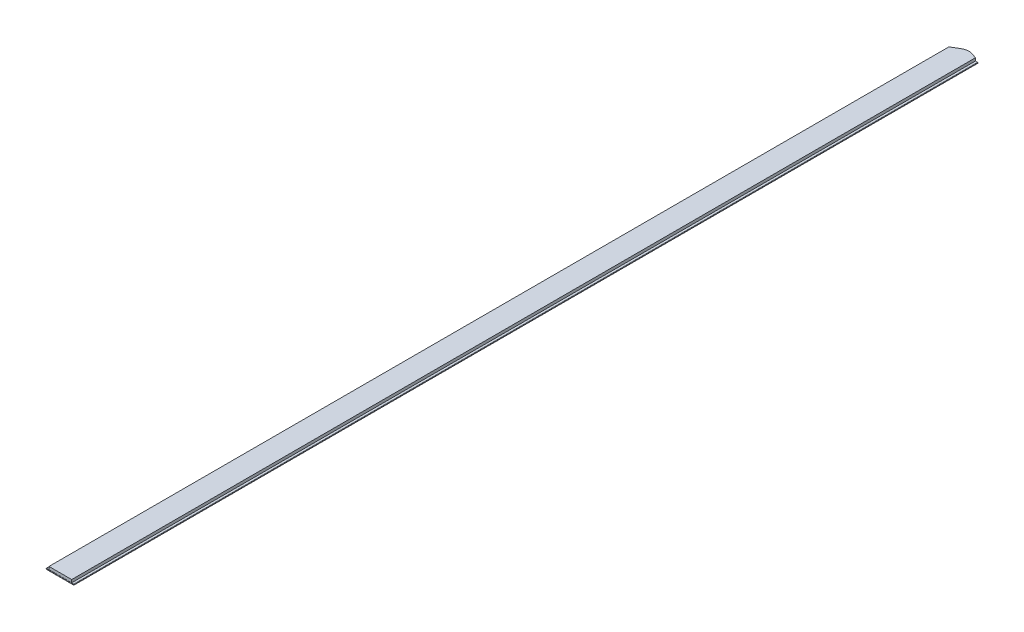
ISO-10303-21;
HEADER;
FILE_DESCRIPTION(('STEP AP214'),'2;1');
FILE_NAME('part.step','',(''),(''),'','','');
FILE_SCHEMA(('AUTOMOTIVE_DESIGN { 1 0 10303 214 1 1 1 1 }'));
ENDSEC;
DATA;
#1=APPLICATION_CONTEXT('core data for automotive mechanical design processes');
#2=APPLICATION_PROTOCOL_DEFINITION('international standard','automotive_design',2000,#1);
#3=PRODUCT_CONTEXT('',#1,'mechanical');
#4=PRODUCT('Part','Part','',(#3));
#5=PRODUCT_RELATED_PRODUCT_CATEGORY('part','',(#4));
#6=PRODUCT_DEFINITION_FORMATION('','',#4);
#7=PRODUCT_DEFINITION_CONTEXT('part definition',#1,'design');
#8=PRODUCT_DEFINITION('design','',#6,#7);
#9=PRODUCT_DEFINITION_SHAPE('','',#8);
#10=(LENGTH_UNIT() NAMED_UNIT(*) SI_UNIT(.MILLI.,.METRE.));
#11=(NAMED_UNIT(*) PLANE_ANGLE_UNIT() SI_UNIT($,.RADIAN.));
#12=(NAMED_UNIT(*) SI_UNIT($,.STERADIAN.) SOLID_ANGLE_UNIT());
#13=UNCERTAINTY_MEASURE_WITH_UNIT(LENGTH_MEASURE(1.E-05),#10,'distance_accuracy_value','');
#14=(GEOMETRIC_REPRESENTATION_CONTEXT(3) GLOBAL_UNCERTAINTY_ASSIGNED_CONTEXT((#13)) GLOBAL_UNIT_ASSIGNED_CONTEXT((#10,
#11,#12)) REPRESENTATION_CONTEXT('',''));
#15=CARTESIAN_POINT('',(0.,0.,0.));
#16=DIRECTION('',(0.,0.,1.));
#17=DIRECTION('',(1.,0.,0.));
#18=AXIS2_PLACEMENT_3D('',#15,#16,#17);
#19=CARTESIAN_POINT('',(0.,0.3,-320.));
#20=DIRECTION('',(0.,1.,0.));
#21=DIRECTION('',(0.,0.,1.));
#22=AXIS2_PLACEMENT_3D('',#19,#20,#21);
#23=PLANE('',#22);
#24=DIRECTION('',(-1.,0.,0.));
#25=VECTOR('',#24,1.);
#26=CARTESIAN_POINT('',(0.,0.3,0.));
#27=LINE('',#26,#25);
#28=CARTESIAN_POINT('',(9.75,0.3,0.));
#29=VERTEX_POINT('',#28);
#30=CARTESIAN_POINT('',(0.15,0.3,0.));
#31=VERTEX_POINT('',#30);
#32=EDGE_CURVE('E142',#29,#31,#27,.T.);
#33=ORIENTED_EDGE('',*,*,#32,.F.);
#34=DIRECTION('',(0.,0.,1.));
#35=VECTOR('',#34,1.);
#36=CARTESIAN_POINT('',(9.75,0.3,-320.));
#37=LINE('',#36,#35);
#38=CARTESIAN_POINT('',(9.75000000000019,0.3,-318.473259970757));
#39=VERTEX_POINT('',#38);
#40=EDGE_CURVE('E11',#29,#39,#37,.F.);
#41=ORIENTED_EDGE('',*,*,#40,.T.);
#42=CARTESIAN_POINT('',(-1.63967066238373,0.3,-316.676471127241));
#43=CARTESIAN_POINT('',(0.602236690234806,0.3,-315.828406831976));
#44=CARTESIAN_POINT('',(4.44296575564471,0.3,-320.977939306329));
#45=CARTESIAN_POINT('',(10.1434829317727,0.3,-317.373909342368));
#46=CARTESIAN_POINT('',(15.6515747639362,0.3,-321.898147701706));
#47=CARTESIAN_POINT('',(17.053288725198,0.3,-332.163947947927));
#48=CARTESIAN_POINT('',(10.7824810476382,0.3,-332.17101837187));
#49=CARTESIAN_POINT('',(1.13918395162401,0.3,-332.450965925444));
#50=CARTESIAN_POINT('',(-5.98283750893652,0.3,-332.883643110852));
#51=CARTESIAN_POINT('',(-6.18735625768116,0.3,-322.977098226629));
#52=CARTESIAN_POINT('',(-3.10281714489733,0.3,-317.229947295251));
#53=CARTESIAN_POINT('',(-1.63967066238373,0.3,-316.676471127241));
#54=B_SPLINE_CURVE_WITH_KNOTS('',3,(#42,#43,#44,#45,#46,#47,#48,#49,#50,#51,#52,#53),
.UNSPECIFIED.,.T.,.F.,(4,1,1,1,1,1,1,1,1,4),(0.,0.140766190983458,0.205480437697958,
0.311340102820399,0.455360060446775,0.633885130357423,0.666506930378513,0.78157806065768,
0.908131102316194,1.),.UNSPECIFIED.);
#55=CARTESIAN_POINT('',(9.00000000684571,0.3,-318.542750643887));
#56=VERTEX_POINT('',#55);
#57=EDGE_CURVE('E196',#56,#39,#54,.T.);
#58=ORIENTED_EDGE('',*,*,#57,.F.);
#59=DIRECTION('',(0.,0.,1.));
#60=VECTOR('',#59,1.);
#61=CARTESIAN_POINT('',(9.,0.3,-320.));
#62=LINE('',#61,#60);
#63=CARTESIAN_POINT('',(9.,0.3,-0.05));
#64=VERTEX_POINT('',#63);
#65=EDGE_CURVE('E127',#56,#64,#62,.T.);
#66=ORIENTED_EDGE('',*,*,#65,.T.);
#67=DIRECTION('',(1.,0.,0.));
#68=VECTOR('',#67,1.);
#69=CARTESIAN_POINT('',(0.648691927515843,0.3,-0.05));
#70=LINE('',#69,#68);
#71=CARTESIAN_POINT('',(1.,0.3,-0.05));
#72=VERTEX_POINT('',#71);
#73=EDGE_CURVE('E110',#72,#64,#70,.T.);
#74=ORIENTED_EDGE('',*,*,#73,.F.);
#75=DIRECTION('',(0.,0.,1.));
#76=VECTOR('',#75,1.);
#77=CARTESIAN_POINT('',(1.,0.3,-320.));
#78=LINE('',#77,#76);
#79=CARTESIAN_POINT('',(0.999999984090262,0.3,-317.138480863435));
#80=VERTEX_POINT('',#79);
#81=EDGE_CURVE('E124',#80,#72,#78,.T.);
#82=ORIENTED_EDGE('',*,*,#81,.F.);
#83=CARTESIAN_POINT('',(-1.63967066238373,0.3,-316.676471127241));
#84=CARTESIAN_POINT('',(0.602236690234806,0.3,-315.828406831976));
#85=CARTESIAN_POINT('',(4.44296575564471,0.3,-320.977939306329));
#86=CARTESIAN_POINT('',(10.1434829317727,0.3,-317.373909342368));
#87=CARTESIAN_POINT('',(15.6515747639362,0.3,-321.898147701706));
#88=CARTESIAN_POINT('',(17.053288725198,0.3,-332.163947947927));
#89=CARTESIAN_POINT('',(10.7824810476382,0.3,-332.17101837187));
#90=CARTESIAN_POINT('',(1.13918395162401,0.3,-332.450965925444));
#91=CARTESIAN_POINT('',(-5.98283750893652,0.3,-332.883643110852));
#92=CARTESIAN_POINT('',(-6.18735625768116,0.3,-322.977098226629));
#93=CARTESIAN_POINT('',(-3.10281714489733,0.3,-317.229947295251));
#94=CARTESIAN_POINT('',(-1.63967066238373,0.3,-316.676471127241));
#95=B_SPLINE_CURVE_WITH_KNOTS('',3,(#83,#84,#85,#86,#87,#88,#89,#90,#91,#92,#93,#94),
.UNSPECIFIED.,.T.,.F.,(4,1,1,1,1,1,1,1,1,4),(0.,0.140766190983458,0.205480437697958,
0.311340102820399,0.455360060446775,0.633885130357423,0.666506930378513,0.78157806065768,
0.908131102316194,1.),.UNSPECIFIED.);
#96=CARTESIAN_POINT('',(0.149999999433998,0.3,-316.752247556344));
#97=VERTEX_POINT('',#96);
#98=EDGE_CURVE('E209',#97,#80,#95,.T.);
#99=ORIENTED_EDGE('',*,*,#98,.F.);
#100=DIRECTION('',(0.,0.,1.));
#101=VECTOR('',#100,1.);
#102=CARTESIAN_POINT('',(0.15,0.3,-320.));
#103=LINE('',#102,#101);
#104=EDGE_CURVE('E41',#97,#31,#103,.T.);
#105=ORIENTED_EDGE('',*,*,#104,.T.);
#106=EDGE_LOOP('',(#33,#41,#58,#66,#74,#82,#99,#105));
#107=FACE_BOUND('',#106,.T.);
#108=ADVANCED_FACE('F31',(#107),#23,.T.);
#109=CARTESIAN_POINT('',(1.,0.3,-320.));
#110=DIRECTION('',(-1.,0.,0.));
#111=DIRECTION('',(0.,0.,1.));
#112=AXIS2_PLACEMENT_3D('',#109,#110,#111);
#113=PLANE('',#112);
#114=DIRECTION('',(0.,-1.,0.));
#115=VECTOR('',#114,1.);
#116=CARTESIAN_POINT('',(1.,0.3,-0.0499999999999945));
#117=LINE('',#116,#115);
#118=CARTESIAN_POINT('',(1.,1.3,-0.0499999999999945));
#119=VERTEX_POINT('',#118);
#120=EDGE_CURVE('E107',#119,#72,#117,.T.);
#121=ORIENTED_EDGE('',*,*,#120,.F.);
#122=DIRECTION('',(0.,0.,1.));
#123=VECTOR('',#122,1.);
#124=CARTESIAN_POINT('',(1.,1.3,-320.));
#125=LINE('',#124,#123);
#126=CARTESIAN_POINT('',(0.999999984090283,1.3,-317.138480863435));
#127=VERTEX_POINT('',#126);
#128=EDGE_CURVE('E135',#127,#119,#125,.T.);
#129=ORIENTED_EDGE('',*,*,#128,.F.);
#130=DIRECTION('',(0.,1.,0.));
#131=VECTOR('',#130,1.);
#132=CARTESIAN_POINT('',(1.,-0.7,-317.13848087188));
#133=LINE('',#132,#131);
#134=EDGE_CURVE('E133',#80,#127,#133,.T.);
#135=ORIENTED_EDGE('',*,*,#134,.F.);
#136=ORIENTED_EDGE('',*,*,#81,.T.);
#137=EDGE_LOOP('',(#121,#129,#135,#136));
#138=FACE_BOUND('',#137,.T.);
#139=ADVANCED_FACE('F132',(#138),#113,.T.);
#140=CARTESIAN_POINT('',(1.,1.3,-320.));
#141=DIRECTION('',(0.,1.,0.));
#142=DIRECTION('',(0.,0.,1.));
#143=AXIS2_PLACEMENT_3D('',#140,#141,#142);
#144=PLANE('',#143);
#145=DIRECTION('',(-1.,0.,0.));
#146=VECTOR('',#145,1.);
#147=CARTESIAN_POINT('',(1.,1.3,-0.0499999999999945));
#148=LINE('',#147,#146);
#149=CARTESIAN_POINT('',(9.,1.3,-0.0499999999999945));
#150=VERTEX_POINT('',#149);
#151=EDGE_CURVE('E113',#150,#119,#148,.T.);
#152=ORIENTED_EDGE('',*,*,#151,.F.);
#153=DIRECTION('',(0.,0.,1.));
#154=VECTOR('',#153,1.);
#155=CARTESIAN_POINT('',(9.,1.3,-320.));
#156=LINE('',#155,#154);
#157=CARTESIAN_POINT('',(9.00000000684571,1.3,-318.542750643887));
#158=VERTEX_POINT('',#157);
#159=EDGE_CURVE('E139',#158,#150,#156,.T.);
#160=ORIENTED_EDGE('',*,*,#159,.F.);
#161=CARTESIAN_POINT('',(-1.63967066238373,1.3,-316.676471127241));
#162=CARTESIAN_POINT('',(0.602236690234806,1.3,-315.828406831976));
#163=CARTESIAN_POINT('',(4.44296575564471,1.3,-320.977939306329));
#164=CARTESIAN_POINT('',(10.1434829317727,1.3,-317.373909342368));
#165=CARTESIAN_POINT('',(15.6515747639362,1.3,-321.898147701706));
#166=CARTESIAN_POINT('',(17.053288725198,1.3,-332.163947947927));
#167=CARTESIAN_POINT('',(10.7824810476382,1.3,-332.17101837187));
#168=CARTESIAN_POINT('',(1.13918395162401,1.3,-332.450965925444));
#169=CARTESIAN_POINT('',(-5.98283750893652,1.3,-332.883643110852));
#170=CARTESIAN_POINT('',(-6.18735625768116,1.3,-322.977098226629));
#171=CARTESIAN_POINT('',(-3.10281714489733,1.3,-317.229947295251));
#172=CARTESIAN_POINT('',(-1.63967066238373,1.3,-316.676471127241));
#173=B_SPLINE_CURVE_WITH_KNOTS('',3,(#161,#162,#163,#164,#165,#166,#167,#168,#169,#170,#171,
#172),.UNSPECIFIED.,.T.,.F.,(4,1,1,1,1,1,1,1,1,4),(0.,0.140766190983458,0.205480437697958,
0.311340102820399,0.455360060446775,0.633885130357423,0.666506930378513,0.78157806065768,
0.908131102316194,1.),.UNSPECIFIED.);
#174=EDGE_CURVE('E118',#127,#158,#173,.T.);
#175=ORIENTED_EDGE('',*,*,#174,.F.);
#176=ORIENTED_EDGE('',*,*,#128,.T.);
#177=EDGE_LOOP('',(#152,#160,#175,#176));
#178=FACE_BOUND('',#177,.T.);
#179=ADVANCED_FACE('F252',(#178),#144,.T.);
#180=CARTESIAN_POINT('',(9.,0.3,-320.));
#181=DIRECTION('',(1.,0.,0.));
#182=DIRECTION('',(0.,0.,-1.));
#183=AXIS2_PLACEMENT_3D('',#180,#181,#182);
#184=PLANE('',#183);
#185=DIRECTION('',(0.,1.,0.));
#186=VECTOR('',#185,1.);
#187=CARTESIAN_POINT('',(9.,0.3,-0.0499999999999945));
#188=LINE('',#187,#186);
#189=EDGE_CURVE('E128',#64,#150,#188,.T.);
#190=ORIENTED_EDGE('',*,*,#189,.F.);
#191=ORIENTED_EDGE('',*,*,#65,.F.);
#192=DIRECTION('',(0.,1.,0.));
#193=VECTOR('',#192,1.);
#194=CARTESIAN_POINT('',(9.00000000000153,-0.7,-318.54275064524));
#195=LINE('',#194,#193);
#196=EDGE_CURVE('E204',#158,#56,#195,.F.);
#197=ORIENTED_EDGE('',*,*,#196,.F.);
#198=ORIENTED_EDGE('',*,*,#159,.T.);
#199=EDGE_LOOP('',(#190,#191,#197,#198));
#200=FACE_BOUND('',#199,.T.);
#201=ADVANCED_FACE('F250',(#200),#184,.T.);
#202=CARTESIAN_POINT('',(0.,0.,-320.));
#203=DIRECTION('',(0.,-1.,0.));
#204=DIRECTION('',(0.,0.,-1.));
#205=AXIS2_PLACEMENT_3D('',#202,#203,#204);
#206=PLANE('',#205);
#207=CARTESIAN_POINT('',(-1.63967066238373,0.,-316.676471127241));
#208=CARTESIAN_POINT('',(0.602236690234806,0.,-315.828406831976));
#209=CARTESIAN_POINT('',(4.44296575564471,0.,-320.977939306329));
#210=CARTESIAN_POINT('',(10.1434829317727,0.,-317.373909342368));
#211=CARTESIAN_POINT('',(15.6515747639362,0.,-321.898147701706));
#212=CARTESIAN_POINT('',(17.053288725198,0.,-332.163947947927));
#213=CARTESIAN_POINT('',(10.7824810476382,0.,-332.17101837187));
#214=CARTESIAN_POINT('',(1.13918395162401,0.,-332.450965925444));
#215=CARTESIAN_POINT('',(-5.98283750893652,0.,-332.883643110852));
#216=CARTESIAN_POINT('',(-6.18735625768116,0.,-322.977098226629));
#217=CARTESIAN_POINT('',(-3.10281714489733,0.,-317.229947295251));
#218=CARTESIAN_POINT('',(-1.63967066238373,0.,-316.676471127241));
#219=B_SPLINE_CURVE_WITH_KNOTS('',3,(#207,#208,#209,#210,#211,#212,#213,#214,#215,#216,#217,
#218),.UNSPECIFIED.,.T.,.F.,(4,1,1,1,1,1,1,1,1,4),(0.,0.140766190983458,0.205480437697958,
0.311340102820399,0.455360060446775,0.633885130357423,0.666506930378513,0.78157806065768,
0.908131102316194,1.),.UNSPECIFIED.);
#220=CARTESIAN_POINT('',(9.75000000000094,0.,-318.473259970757));
#221=VERTEX_POINT('',#220);
#222=CARTESIAN_POINT('',(0.14999999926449,0.,-316.752247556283));
#223=VERTEX_POINT('',#222);
#224=EDGE_CURVE('E134',#221,#223,#219,.F.);
#225=ORIENTED_EDGE('',*,*,#224,.F.);
#226=DIRECTION('',(0.,0.,1.));
#227=VECTOR('',#226,1.);
#228=CARTESIAN_POINT('',(9.75,0.,-320.));
#229=LINE('',#228,#227);
#230=CARTESIAN_POINT('',(9.75,0.,0.));
#231=VERTEX_POINT('',#230);
#232=EDGE_CURVE('E155',#221,#231,#229,.T.);
#233=ORIENTED_EDGE('',*,*,#232,.T.);
#234=DIRECTION('',(1.,0.,0.));
#235=VECTOR('',#234,1.);
#236=CARTESIAN_POINT('',(0.,0.,0.));
#237=LINE('',#236,#235);
#238=CARTESIAN_POINT('',(0.15,0.,0.));
#239=VERTEX_POINT('',#238);
#240=EDGE_CURVE('E216',#239,#231,#237,.T.);
#241=ORIENTED_EDGE('',*,*,#240,.F.);
#242=DIRECTION('',(0.,0.,1.));
#243=VECTOR('',#242,1.);
#244=CARTESIAN_POINT('',(0.15,0.,-320.));
#245=LINE('',#244,#243);
#246=EDGE_CURVE('E137',#239,#223,#245,.F.);
#247=ORIENTED_EDGE('',*,*,#246,.T.);
#248=EDGE_LOOP('',(#225,#233,#241,#247));
#249=FACE_BOUND('',#248,.T.);
#250=ADVANCED_FACE('F234',(#249),#206,.T.);
#251=CARTESIAN_POINT('',(0.,0.3,0.));
#252=DIRECTION('',(0.,0.,-1.));
#253=DIRECTION('',(-1.,0.,0.));
#254=AXIS2_PLACEMENT_3D('',#251,#252,#253);
#255=PLANE('',#254);
#256=ORIENTED_EDGE('',*,*,#240,.T.);
#257=CARTESIAN_POINT('',(9.75,0.15,0.));
#258=DIRECTION('',(0.,0.,-1.));
#259=DIRECTION('',(-1.,0.,0.));
#260=AXIS2_PLACEMENT_3D('',#257,#258,#259);
#261=CIRCLE('',#260,0.15);
#262=CARTESIAN_POINT('',(9.9,0.15,0.));
#263=VERTEX_POINT('',#262);
#264=EDGE_CURVE('E164',#231,#263,#261,.F.);
#265=ORIENTED_EDGE('',*,*,#264,.T.);
#266=CARTESIAN_POINT('',(9.75,0.15,0.));
#267=DIRECTION('',(0.,0.,-1.));
#268=DIRECTION('',(-1.,0.,0.));
#269=AXIS2_PLACEMENT_3D('',#266,#267,#268);
#270=CIRCLE('',#269,0.15);
#271=EDGE_CURVE('E162',#263,#29,#270,.F.);
#272=ORIENTED_EDGE('',*,*,#271,.T.);
#273=ORIENTED_EDGE('',*,*,#32,.T.);
#274=CARTESIAN_POINT('',(0.15,0.15,0.));
#275=DIRECTION('',(0.,0.,-1.));
#276=DIRECTION('',(-1.,0.,0.));
#277=AXIS2_PLACEMENT_3D('',#274,#275,#276);
#278=CIRCLE('',#277,0.15);
#279=CARTESIAN_POINT('',(0.,0.15,0.));
#280=VERTEX_POINT('',#279);
#281=EDGE_CURVE('E158',#31,#280,#278,.F.);
#282=ORIENTED_EDGE('',*,*,#281,.T.);
#283=CARTESIAN_POINT('',(0.15,0.15,0.));
#284=DIRECTION('',(0.,0.,-1.));
#285=DIRECTION('',(-1.,0.,0.));
#286=AXIS2_PLACEMENT_3D('',#283,#284,#285);
#287=CIRCLE('',#286,0.15);
#288=EDGE_CURVE('E160',#280,#239,#287,.F.);
#289=ORIENTED_EDGE('',*,*,#288,.T.);
#290=EDGE_LOOP('',(#256,#265,#272,#273,#282,#289));
#291=FACE_BOUND('',#290,.T.);
#292=ADVANCED_FACE('F181',(#291),#255,.F.);
#293=CARTESIAN_POINT('',(-1.63967066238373,-0.7,-316.676471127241));
#294=CARTESIAN_POINT('',(0.602236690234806,-0.7,-315.828406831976));
#295=CARTESIAN_POINT('',(4.44296575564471,-0.7,-320.977939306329));
#296=CARTESIAN_POINT('',(10.1434829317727,-0.7,-317.373909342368));
#297=CARTESIAN_POINT('',(15.6515747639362,-0.7,-321.898147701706));
#298=CARTESIAN_POINT('',(17.053288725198,-0.7,-332.163947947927));
#299=CARTESIAN_POINT('',(10.7824810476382,-0.7,-332.17101837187));
#300=CARTESIAN_POINT('',(1.13918395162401,-0.7,-332.450965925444));
#301=CARTESIAN_POINT('',(-5.98283750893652,-0.7,-332.883643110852));
#302=CARTESIAN_POINT('',(-6.18735625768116,-0.7,-322.977098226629));
#303=CARTESIAN_POINT('',(-3.10281714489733,-0.7,-317.229947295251));
#304=CARTESIAN_POINT('',(-1.63967066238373,-0.7,-316.676471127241));
#305=B_SPLINE_CURVE_WITH_KNOTS('',3,(#293,#294,#295,#296,#297,#298,#299,#300,#301,#302,#303,
#304),.UNSPECIFIED.,.T.,.F.,(4,1,1,1,1,1,1,1,1,4),(0.,0.140766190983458,0.205480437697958,
0.311340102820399,0.455360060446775,0.633885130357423,0.666506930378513,0.78157806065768,
0.908131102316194,1.),.UNSPECIFIED.);
#306=DIRECTION('',(0.,1.,0.));
#307=VECTOR('',#306,1.);
#308=SURFACE_OF_LINEAR_EXTRUSION('',#305,#307);
#309=CARTESIAN_POINT('',(9.75,0.3,-318.473259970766));
#310=CARTESIAN_POINT('',(9.75844091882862,0.300006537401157,-318.473429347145));
#311=CARTESIAN_POINT('',(9.76687820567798,0.299287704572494,-318.473633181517));
#312=CARTESIAN_POINT('',(9.78350576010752,0.296451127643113,-318.474095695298));
#313=CARTESIAN_POINT('',(9.79169622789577,0.294334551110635,-318.474354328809));
#314=CARTESIAN_POINT('',(9.80760880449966,0.288752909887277,-318.474912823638));
#315=CARTESIAN_POINT('',(9.81533070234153,0.285287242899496,-318.47521270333));
#316=CARTESIAN_POINT('',(9.83007713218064,0.277118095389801,-318.475832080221));
#317=CARTESIAN_POINT('',(9.83710177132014,0.272414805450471,-318.476151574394));
#318=CARTESIAN_POINT('',(9.85683365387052,0.256621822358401,-318.477104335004));
#319=CARTESIAN_POINT('',(9.86824239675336,0.243833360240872,-318.477733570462));
#320=CARTESIAN_POINT('',(9.88615404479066,0.2151712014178,-318.478775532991));
#321=CARTESIAN_POINT('',(9.89265762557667,0.199297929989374,-318.479188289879));
#322=CARTESIAN_POINT('',(9.89756751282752,0.177478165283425,-318.47950280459));
#323=CARTESIAN_POINT('',(9.89847877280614,0.172020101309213,-318.479561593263));
#324=CARTESIAN_POINT('',(9.89969359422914,0.161044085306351,-318.479640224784));
#325=CARTESIAN_POINT('',(9.89999800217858,0.155526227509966,-318.479660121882));
#326=CARTESIAN_POINT('',(9.90000000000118,0.150000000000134,-318.479660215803));
#327=B_SPLINE_CURVE_WITH_KNOTS('',3,(#309,#310,#311,#312,#313,#314,#315,#316,#317,#318,#319,
#320,#321,#322,#323,#324,#325,#326),.UNSPECIFIED.,.F.,.F.,(4,2,2,2,2,2,2,2,4),(0.,
0.0252926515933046,0.0505642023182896,0.0758470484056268,0.101126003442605,0.151551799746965,
0.201970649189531,0.218547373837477,0.235100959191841),.UNSPECIFIED.);
#328=CARTESIAN_POINT('',(9.9,0.15,-318.479660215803));
#329=VERTEX_POINT('',#328);
#330=EDGE_CURVE('E245',#39,#329,#327,.T.);
#331=ORIENTED_EDGE('',*,*,#330,.T.);
#332=CARTESIAN_POINT('',(9.9,0.15,-318.479660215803));
#333=CARTESIAN_POINT('',(9.90000660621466,0.141571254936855,-318.479661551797));
#334=CARTESIAN_POINT('',(9.89928976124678,0.133145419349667,-318.479614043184));
#335=CARTESIAN_POINT('',(9.89646080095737,0.116539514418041,-318.479431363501));
#336=CARTESIAN_POINT('',(9.89434989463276,0.108359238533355,-318.479296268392));
#337=CARTESIAN_POINT('',(9.88878303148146,0.0924654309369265,-318.478948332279));
#338=CARTESIAN_POINT('',(9.88532647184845,0.0847521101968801,-318.478735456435));
#339=CARTESIAN_POINT('',(9.87717896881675,0.0700208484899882,-318.478250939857));
#340=CARTESIAN_POINT('',(9.87248820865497,0.0630028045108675,-318.477979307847));
#341=CARTESIAN_POINT('',(9.85673439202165,0.0432818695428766,-318.477108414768));
#342=CARTESIAN_POINT('',(9.84397648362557,0.0318751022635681,-318.476452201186));
#343=CARTESIAN_POINT('',(9.81536111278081,0.0139369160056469,-318.475192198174));
#344=CARTESIAN_POINT('',(9.79949938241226,0.00741227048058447,-318.474588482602));
#345=CARTESIAN_POINT('',(9.77765361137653,0.00246393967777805,-318.473929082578));
#346=CARTESIAN_POINT('',(9.77216153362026,0.00154094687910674,-318.473776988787));
#347=CARTESIAN_POINT('',(9.7611158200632,0.000310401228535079,-318.473498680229));
#348=CARTESIAN_POINT('',(9.75556228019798,1.99662436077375E-06,-318.473372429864));
#349=CARTESIAN_POINT('',(9.75000000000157,-1.45955296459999E-12,-318.473259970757));
#350=B_SPLINE_CURVE_WITH_KNOTS('',3,(#332,#333,#334,#335,#336,#337,#338,#339,#340,#341,#342,
#343,#344,#345,#346,#347,#348,#349),.UNSPECIFIED.,.F.,.F.,(4,2,2,2,2,2,2,2,4),(0.,
0.0252511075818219,0.0504803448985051,0.0757208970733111,0.100957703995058,0.151318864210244,
0.201749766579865,0.218437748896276,0.235102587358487),.UNSPECIFIED.);
#351=EDGE_CURVE('E240',#329,#221,#350,.T.);
#352=ORIENTED_EDGE('',*,*,#351,.T.);
#353=ORIENTED_EDGE('',*,*,#224,.T.);
#354=CARTESIAN_POINT('',(0.15,0.,-316.75224755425));
#355=CARTESIAN_POINT('',(0.141219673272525,2.21270672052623E-06,-316.749070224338));
#356=CARTESIAN_POINT('',(0.132442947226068,0.00077278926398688,-316.745925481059));
#357=CARTESIAN_POINT('',(0.115101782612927,0.00384873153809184,-316.739769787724));
#358=CARTESIAN_POINT('',(0.10653764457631,0.00615615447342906,-316.736759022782));
#359=CARTESIAN_POINT('',(0.0815568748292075,0.0153597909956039,-316.728060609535));
#360=CARTESIAN_POINT('',(0.0657982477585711,0.0245374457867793,-316.722687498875));
#361=CARTESIAN_POINT('',(0.0388170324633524,0.04781072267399,-316.713624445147));
#362=CARTESIAN_POINT('',(0.027450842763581,0.0617162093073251,-316.709880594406));
#363=CARTESIAN_POINT('',(0.0147365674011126,0.0846069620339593,-316.705726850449));
#364=CARTESIAN_POINT('',(0.0112616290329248,0.0923434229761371,-316.704598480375));
#365=CARTESIAN_POINT('',(0.00565663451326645,0.108335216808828,-316.702783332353));
#366=CARTESIAN_POINT('',(0.0035247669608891,0.116589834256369,-316.702095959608));
#367=CARTESIAN_POINT('',(0.000701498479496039,0.133231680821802,-316.701187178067));
#368=CARTESIAN_POINT('',(-1.19804401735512E-05,0.141614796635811,-316.7009586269));
#369=CARTESIAN_POINT('',(0.,0.14999999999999,-316.70096166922));
#370=B_SPLINE_CURVE_WITH_KNOTS('',3,(#354,#355,#356,#357,#358,#359,#360,#361,#362,#363,#364,
#365,#366,#367,#368,#369),.UNSPECIFIED.,.F.,.F.,(4,2,2,2,2,2,2,4),(0.,0.0279506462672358,
0.0559387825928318,0.111752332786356,0.165544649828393,0.191100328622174,0.216621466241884,
0.241742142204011),.UNSPECIFIED.);
#371=CARTESIAN_POINT('',(0.,0.15,-316.70096166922));
#372=VERTEX_POINT('',#371);
#373=EDGE_CURVE('E54',#223,#372,#370,.T.);
#374=ORIENTED_EDGE('',*,*,#373,.T.);
#375=CARTESIAN_POINT('',(0.,0.15,-316.70096166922));
#376=CARTESIAN_POINT('',(-7.94650092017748E-06,0.15813668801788,-316.700959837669));
#377=CARTESIAN_POINT('',(0.000661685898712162,0.166268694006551,-316.701174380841));
#378=CARTESIAN_POINT('',(0.00329302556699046,0.18228220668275,-316.702021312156));
#379=CARTESIAN_POINT('',(0.00525211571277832,0.190164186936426,-316.702652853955));
#380=CARTESIAN_POINT('',(0.0103999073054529,0.205471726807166,-316.704319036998));
#381=CARTESIAN_POINT('',(0.0135886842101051,0.212897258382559,-316.705353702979));
#382=CARTESIAN_POINT('',(0.0210754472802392,0.22709158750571,-316.707796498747));
#383=CARTESIAN_POINT('',(0.0253736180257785,0.233860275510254,-316.709204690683));
#384=CARTESIAN_POINT('',(0.0399105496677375,0.253154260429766,-316.71399976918));
#385=CARTESIAN_POINT('',(0.0517051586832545,0.264419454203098,-316.717929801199));
#386=CARTESIAN_POINT('',(0.0785642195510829,0.282950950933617,-316.727044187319));
#387=CARTESIAN_POINT('',(0.0937544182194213,0.290008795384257,-316.732278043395));
#388=CARTESIAN_POINT('',(0.116121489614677,0.296287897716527,-316.740133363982));
#389=CARTESIAN_POINT('',(0.122841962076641,0.297680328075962,-316.742511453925));
#390=CARTESIAN_POINT('',(0.136373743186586,0.299534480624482,-316.747335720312));
#391=CARTESIAN_POINT('',(0.143184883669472,0.299997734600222,-316.749781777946));
#392=CARTESIAN_POINT('',(0.149999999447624,0.300000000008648,-316.752247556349));
#393=B_SPLINE_CURVE_WITH_KNOTS('',3,(#375,#376,#377,#378,#379,#380,#381,#382,#383,#384,#385,
#386,#387,#388,#389,#390,#391,#392),.UNSPECIFIED.,.F.,.F.,(4,2,2,2,2,2,2,2,4),(0.,
0.0243723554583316,0.0486953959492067,0.0730199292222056,0.097348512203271,0.146760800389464,
0.198452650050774,0.220194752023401,0.241900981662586),.UNSPECIFIED.);
#394=EDGE_CURVE('E49',#372,#97,#393,.T.);
#395=ORIENTED_EDGE('',*,*,#394,.T.);
#396=ORIENTED_EDGE('',*,*,#98,.T.);
#397=ORIENTED_EDGE('',*,*,#134,.T.);
#398=ORIENTED_EDGE('',*,*,#174,.T.);
#399=ORIENTED_EDGE('',*,*,#196,.T.);
#400=ORIENTED_EDGE('',*,*,#57,.T.);
#401=EDGE_LOOP('',(#331,#352,#353,#374,#395,#396,#397,#398,#399,#400));
#402=FACE_BOUND('',#401,.T.);
#403=ADVANCED_FACE('F175',(#402),#308,.F.);
#404=CARTESIAN_POINT('',(0.648691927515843,1.66839125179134,-0.05));
#405=DIRECTION('',(0.,0.,-1.));
#406=DIRECTION('',(-1.,0.,0.));
#407=AXIS2_PLACEMENT_3D('',#404,#405,#406);
#408=PLANE('',#407);
#409=ORIENTED_EDGE('',*,*,#120,.T.);
#410=ORIENTED_EDGE('',*,*,#73,.T.);
#411=ORIENTED_EDGE('',*,*,#189,.T.);
#412=ORIENTED_EDGE('',*,*,#151,.T.);
#413=EDGE_LOOP('',(#409,#410,#411,#412));
#414=FACE_BOUND('',#413,.T.);
#415=ADVANCED_FACE('F109',(#414),#408,.F.);
#416=CARTESIAN_POINT('',(9.75,0.15,-320.));
#417=DIRECTION('',(0.,0.,1.));
#418=DIRECTION('',(1.,0.,0.));
#419=AXIS2_PLACEMENT_3D('',#416,#417,#418);
#420=CYLINDRICAL_SURFACE('',#419,0.15);
#421=DIRECTION('',(0.,0.,1.));
#422=VECTOR('',#421,1.);
#423=CARTESIAN_POINT('',(9.9,0.15,-320.));
#424=LINE('',#423,#422);
#425=EDGE_CURVE('E129',#329,#263,#424,.T.);
#426=ORIENTED_EDGE('',*,*,#425,.F.);
#427=ORIENTED_EDGE('',*,*,#330,.F.);
#428=ORIENTED_EDGE('',*,*,#40,.F.);
#429=ORIENTED_EDGE('',*,*,#271,.F.);
#430=EDGE_LOOP('',(#426,#427,#428,#429));
#431=FACE_BOUND('',#430,.T.);
#432=ADVANCED_FACE('F243',(#431),#420,.T.);
#433=CARTESIAN_POINT('',(9.75,0.15,-320.));
#434=DIRECTION('',(0.,0.,1.));
#435=DIRECTION('',(1.,0.,0.));
#436=AXIS2_PLACEMENT_3D('',#433,#434,#435);
#437=CYLINDRICAL_SURFACE('',#436,0.15);
#438=ORIENTED_EDGE('',*,*,#351,.F.);
#439=ORIENTED_EDGE('',*,*,#425,.T.);
#440=ORIENTED_EDGE('',*,*,#264,.F.);
#441=ORIENTED_EDGE('',*,*,#232,.F.);
#442=EDGE_LOOP('',(#438,#439,#440,#441));
#443=FACE_BOUND('',#442,.T.);
#444=ADVANCED_FACE('F238',(#443),#437,.T.);
#445=CARTESIAN_POINT('',(0.15,0.15,-320.));
#446=DIRECTION('',(0.,0.,1.));
#447=DIRECTION('',(1.,0.,0.));
#448=AXIS2_PLACEMENT_3D('',#445,#446,#447);
#449=CYLINDRICAL_SURFACE('',#448,0.15);
#450=ORIENTED_EDGE('',*,*,#104,.F.);
#451=ORIENTED_EDGE('',*,*,#394,.F.);
#452=DIRECTION('',(0.,0.,1.));
#453=VECTOR('',#452,1.);
#454=CARTESIAN_POINT('',(0.,0.15,-320.));
#455=LINE('',#454,#453);
#456=EDGE_CURVE('E36',#280,#372,#455,.F.);
#457=ORIENTED_EDGE('',*,*,#456,.F.);
#458=ORIENTED_EDGE('',*,*,#281,.F.);
#459=EDGE_LOOP('',(#450,#451,#457,#458));
#460=FACE_BOUND('',#459,.T.);
#461=ADVANCED_FACE('F33',(#460),#449,.T.);
#462=CARTESIAN_POINT('',(0.15,0.15,-320.));
#463=DIRECTION('',(0.,0.,1.));
#464=DIRECTION('',(1.,0.,0.));
#465=AXIS2_PLACEMENT_3D('',#462,#463,#464);
#466=CYLINDRICAL_SURFACE('',#465,0.15);
#467=ORIENTED_EDGE('',*,*,#373,.F.);
#468=ORIENTED_EDGE('',*,*,#246,.F.);
#469=ORIENTED_EDGE('',*,*,#288,.F.);
#470=ORIENTED_EDGE('',*,*,#456,.T.);
#471=EDGE_LOOP('',(#467,#468,#469,#470));
#472=FACE_BOUND('',#471,.T.);
#473=ADVANCED_FACE('F231',(#472),#466,.T.);
#474=CLOSED_SHELL('',(#108,#139,#179,#201,#250,#292,#403,#415,#432,#444,#461,#473));
#475=MANIFOLD_SOLID_BREP('B2',#474);
#476=ADVANCED_BREP_SHAPE_REPRESENTATION('',(#18,#475),#14);
#477=SHAPE_DEFINITION_REPRESENTATION(#9,#476);
ENDSEC;
END-ISO-10303-21;
